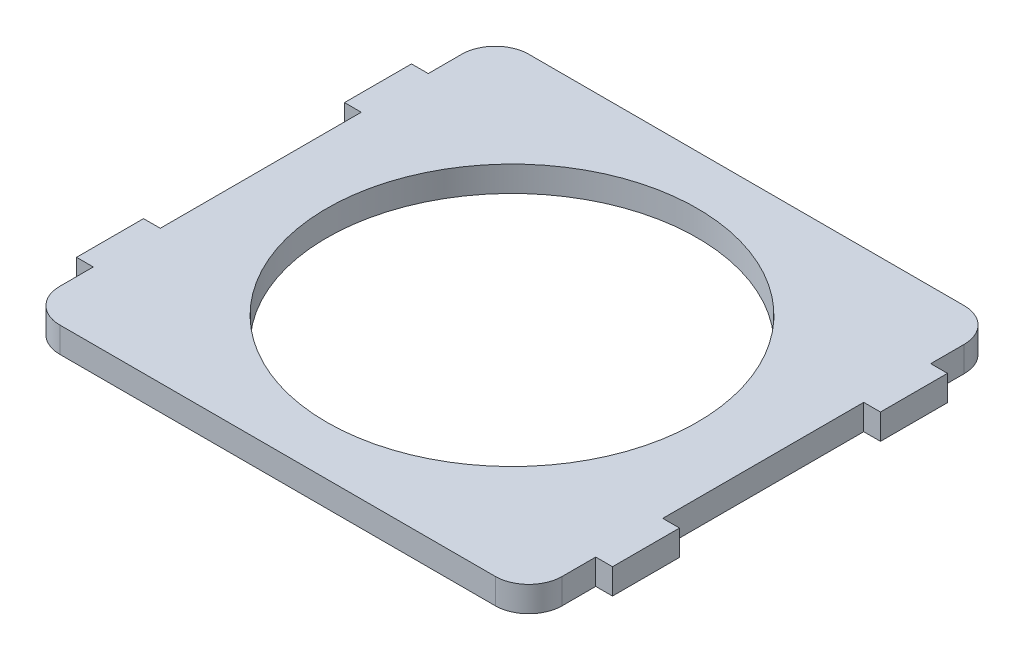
from build123d import *

# Parameters (mm, degrees)
SKETCH1_R      = 70.231
EXTRUDE1_DEPTH = 9.652
FILLET1_R      = 12.7


with BuildPart() as part:
    # Sketch1 → Extrude1 (new body)
    with BuildSketch(Plane(origin=(0, 0, 0), x_dir=(1, 0, 0), z_dir=(0, 1, 0))):
        Polygon((0, 0), (190.5, 0), (190.5, 25.4), (196.85, 25.4), (196.85, 50.8), (190.5, 50.8), (190.5, 127), (196.85, 127), (196.85, 152.4), (190.5, 152.4), (190.5, 177.8), (0, 177.8), (0, 152.4), (-6.35, 152.4), (-6.35, 127), (0, 127), (0, 50.8), (-6.35, 50.8), (-6.35, 25.4), (0, 25.4), align=None)
        with Locations(Location((95.25, 88.9, 0), (0, 0, 270))):
            Circle(SKETCH1_R, mode=Mode.SUBTRACT)
    extrude(amount=EXTRUDE1_DEPTH)

    # Fillet1
    fillet1_edges = [part.edges().sort_by_distance(p)[0] for p in [
        (0, 4.826, -177.8),
        (190.5, 4.826, -177.8),
        (190.5, 4.826, 0),
        (0, 4.826, 0),
    ]]
    fillet(fillet1_edges, radius=FILLET1_R)


solid = part.part
